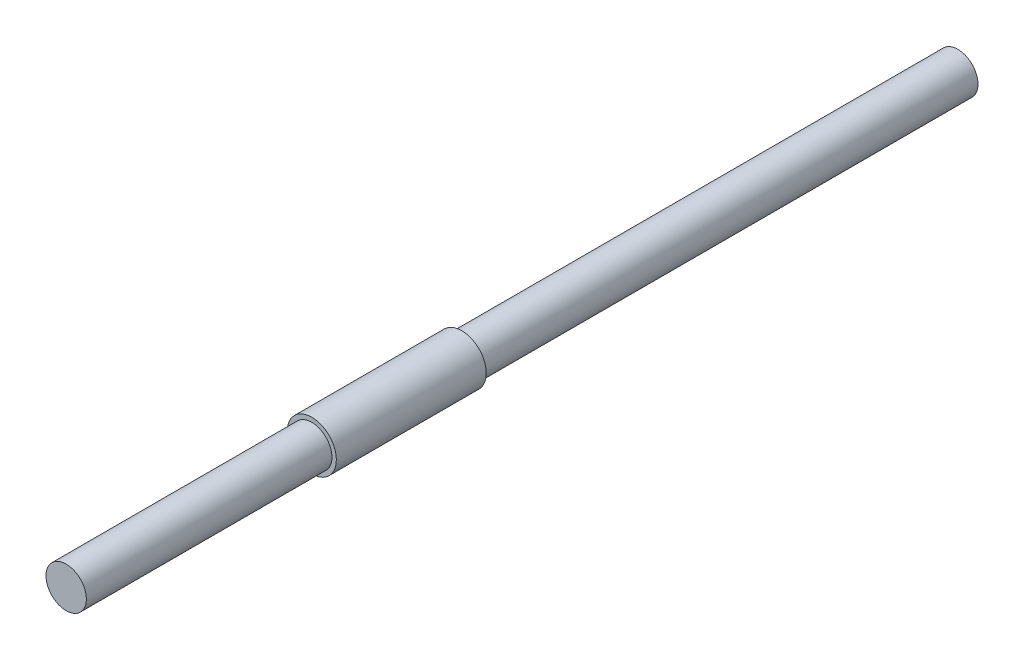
from build123d import *

# Parameters (mm, degrees)
BOSS_EXTRUDE1_DEPTH      = 33.274
BOSS_EXTRUDE1_DEPTH_BACK = 24.13
SKETCH1_R                = 1.3
SKETCH2_R                = 1.58212494
BOSS_EXTRUDE2_DEPTH      = 9.652


with BuildPart() as part:
    # Sketch1 → Boss-Extrude1 (new, two sides: drawn at the far end of the back side and taken through both)
    with BuildSketch(Plane.XY.offset(-BOSS_EXTRUDE1_DEPTH_BACK)):
        with Locations((44.45, 95.25)):
            Circle(SKETCH1_R)
    extrude(amount=BOSS_EXTRUDE1_DEPTH + BOSS_EXTRUDE1_DEPTH_BACK)

    # Sketch2 → Boss-Extrude2 (add)
    with BuildSketch(Plane.XY.offset(17.4625)):
        with Locations((44.45, 95.25)):
            Circle(SKETCH2_R)
    extrude(amount=-BOSS_EXTRUDE2_DEPTH)


solid = part.part
